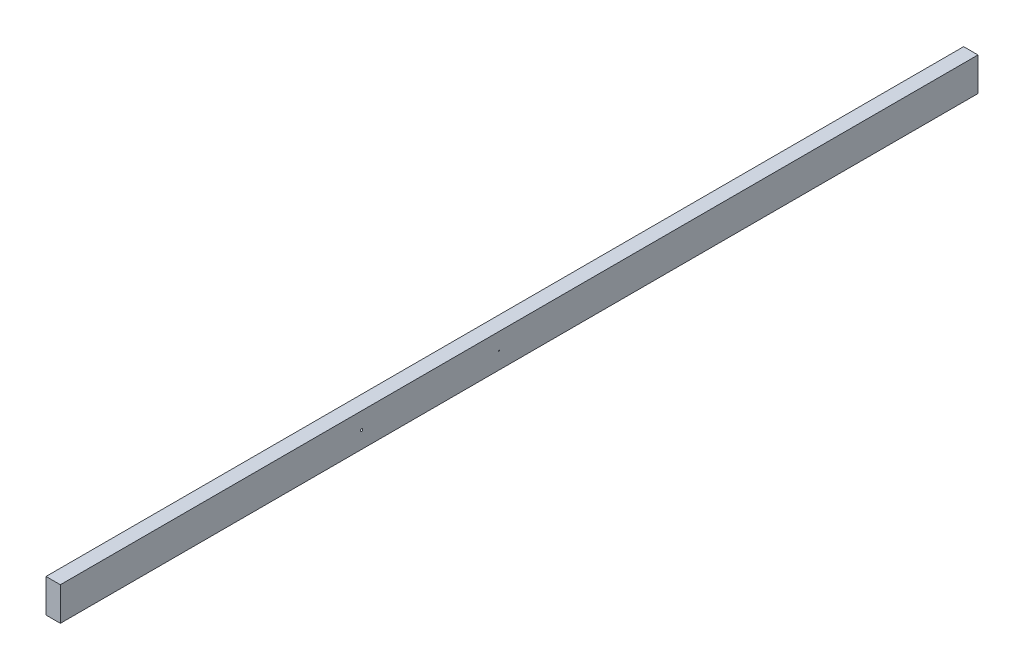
ISO-10303-21;
HEADER;
FILE_DESCRIPTION(('STEP AP214'),'2;1');
FILE_NAME('part.step','',(''),(''),'','','');
FILE_SCHEMA(('AUTOMOTIVE_DESIGN { 1 0 10303 214 1 1 1 1 }'));
ENDSEC;
DATA;
#1=APPLICATION_CONTEXT('core data for automotive mechanical design processes');
#2=APPLICATION_PROTOCOL_DEFINITION('international standard','automotive_design',2000,#1);
#3=PRODUCT_CONTEXT('',#1,'mechanical');
#4=PRODUCT('Part','Part','',(#3));
#5=PRODUCT_RELATED_PRODUCT_CATEGORY('part','',(#4));
#6=PRODUCT_DEFINITION_FORMATION('','',#4);
#7=PRODUCT_DEFINITION_CONTEXT('part definition',#1,'design');
#8=PRODUCT_DEFINITION('design','',#6,#7);
#9=PRODUCT_DEFINITION_SHAPE('','',#8);
#10=(LENGTH_UNIT() NAMED_UNIT(*) SI_UNIT(.MILLI.,.METRE.));
#11=(NAMED_UNIT(*) PLANE_ANGLE_UNIT() SI_UNIT($,.RADIAN.));
#12=(NAMED_UNIT(*) SI_UNIT($,.STERADIAN.) SOLID_ANGLE_UNIT());
#13=UNCERTAINTY_MEASURE_WITH_UNIT(LENGTH_MEASURE(1.E-05),#10,'distance_accuracy_value','');
#14=(GEOMETRIC_REPRESENTATION_CONTEXT(3) GLOBAL_UNCERTAINTY_ASSIGNED_CONTEXT((#13)) GLOBAL_UNIT_ASSIGNED_CONTEXT((#10,
#11,#12)) REPRESENTATION_CONTEXT('',''));
#15=CARTESIAN_POINT('',(0.,0.,0.));
#16=DIRECTION('',(0.,0.,1.));
#17=DIRECTION('',(1.,0.,0.));
#18=AXIS2_PLACEMENT_3D('',#15,#16,#17);
#19=CARTESIAN_POINT('',(19.05,-44.45,-2438.4));
#20=DIRECTION('',(1.,0.,0.));
#21=DIRECTION('',(0.,0.,-1.));
#22=AXIS2_PLACEMENT_3D('',#19,#20,#21);
#23=PLANE('',#22);
#24=CARTESIAN_POINT('',(19.05,0.,-800.1));
#25=DIRECTION('',(-1.,0.,0.));
#26=DIRECTION('',(0.,0.,1.));
#27=AXIS2_PLACEMENT_3D('',#24,#25,#26);
#28=CIRCLE('',#27,3.17500000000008);
#29=CARTESIAN_POINT('',(19.05,0.,-796.925));
#30=VERTEX_POINT('',#29);
#31=EDGE_CURVE('E150',#30,#30,#28,.T.);
#32=ORIENTED_EDGE('',*,*,#31,.T.);
#33=EDGE_LOOP('',(#32));
#34=FACE_BOUND('',#33,.T.);
#35=CARTESIAN_POINT('',(19.05,-1.0662952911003E-13,-1165.8854));
#36=DIRECTION('',(1.,0.,0.));
#37=DIRECTION('',(0.,0.,1.));
#38=AXIS2_PLACEMENT_3D('',#35,#36,#37);
#39=ELLIPSE('',#38,1.68379802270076,1.1906250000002);
#40=CARTESIAN_POINT('',(19.05,-1.10835133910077E-13,-1164.2016019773));
#41=VERTEX_POINT('',#40);
#42=EDGE_CURVE('E160',#41,#41,#39,.T.);
#43=ORIENTED_EDGE('',*,*,#42,.F.);
#44=EDGE_LOOP('',(#43));
#45=FACE_BOUND('',#44,.T.);
#46=DIRECTION('',(0.,1.,0.));
#47=VECTOR('',#46,1.);
#48=CARTESIAN_POINT('',(19.05,-44.45,0.));
#49=LINE('',#48,#47);
#50=CARTESIAN_POINT('',(19.05,-44.45,0.));
#51=VERTEX_POINT('',#50);
#52=CARTESIAN_POINT('',(19.05,44.45,0.));
#53=VERTEX_POINT('',#52);
#54=EDGE_CURVE('E100',#51,#53,#49,.T.);
#55=ORIENTED_EDGE('',*,*,#54,.F.);
#56=DIRECTION('',(0.,0.,1.));
#57=VECTOR('',#56,1.);
#58=CARTESIAN_POINT('',(19.05,-44.45,-2438.4));
#59=LINE('',#58,#57);
#60=CARTESIAN_POINT('',(19.05,-44.45,-2438.4));
#61=VERTEX_POINT('',#60);
#62=EDGE_CURVE('E11',#61,#51,#59,.T.);
#63=ORIENTED_EDGE('',*,*,#62,.F.);
#64=DIRECTION('',(0.,1.,0.));
#65=VECTOR('',#64,1.);
#66=CARTESIAN_POINT('',(19.05,-44.45,-2438.4));
#67=LINE('',#66,#65);
#68=CARTESIAN_POINT('',(19.05,44.45,-2438.4));
#69=VERTEX_POINT('',#68);
#70=EDGE_CURVE('E93',#61,#69,#67,.T.);
#71=ORIENTED_EDGE('',*,*,#70,.T.);
#72=DIRECTION('',(0.,0.,1.));
#73=VECTOR('',#72,1.);
#74=CARTESIAN_POINT('',(19.05,44.45,-2438.4));
#75=LINE('',#74,#73);
#76=EDGE_CURVE('E76',#69,#53,#75,.T.);
#77=ORIENTED_EDGE('',*,*,#76,.T.);
#78=EDGE_LOOP('',(#55,#63,#71,#77));
#79=FACE_BOUND('',#78,.T.);
#80=ADVANCED_FACE('F33',(#34,#45,#79),#23,.T.);
#81=CARTESIAN_POINT('',(-19.05,-44.45,-2438.4));
#82=DIRECTION('',(0.,-1.,0.));
#83=DIRECTION('',(0.,0.,-1.));
#84=AXIS2_PLACEMENT_3D('',#81,#82,#83);
#85=PLANE('',#84);
#86=DIRECTION('',(1.,0.,0.));
#87=VECTOR('',#86,1.);
#88=CARTESIAN_POINT('',(-19.05,-44.45,0.));
#89=LINE('',#88,#87);
#90=CARTESIAN_POINT('',(-19.05,-44.45,0.));
#91=VERTEX_POINT('',#90);
#92=EDGE_CURVE('E95',#91,#51,#89,.T.);
#93=ORIENTED_EDGE('',*,*,#92,.F.);
#94=DIRECTION('',(0.,0.,1.));
#95=VECTOR('',#94,1.);
#96=CARTESIAN_POINT('',(-19.05,-44.45,-2438.4));
#97=LINE('',#96,#95);
#98=CARTESIAN_POINT('',(-19.05,-44.45,-2438.4));
#99=VERTEX_POINT('',#98);
#100=EDGE_CURVE('E42',#99,#91,#97,.T.);
#101=ORIENTED_EDGE('',*,*,#100,.F.);
#102=DIRECTION('',(1.,0.,0.));
#103=VECTOR('',#102,1.);
#104=CARTESIAN_POINT('',(-19.05,-44.45,-2438.4));
#105=LINE('',#104,#103);
#106=EDGE_CURVE('E90',#99,#61,#105,.T.);
#107=ORIENTED_EDGE('',*,*,#106,.T.);
#108=ORIENTED_EDGE('',*,*,#62,.T.);
#109=EDGE_LOOP('',(#93,#101,#107,#108));
#110=FACE_BOUND('',#109,.T.);
#111=ADVANCED_FACE('F110',(#110),#85,.T.);
#112=CARTESIAN_POINT('',(-19.05,-44.45,-2438.4));
#113=DIRECTION('',(-1.,0.,0.));
#114=DIRECTION('',(0.,0.,1.));
#115=AXIS2_PLACEMENT_3D('',#112,#113,#114);
#116=PLANE('',#115);
#117=CARTESIAN_POINT('',(-19.05,0.,-800.1));
#118=DIRECTION('',(-1.,0.,0.));
#119=DIRECTION('',(0.,0.,1.));
#120=AXIS2_PLACEMENT_3D('',#117,#118,#119);
#121=CIRCLE('',#120,3.17500000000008);
#122=CARTESIAN_POINT('',(-19.05,0.,-796.925));
#123=VERTEX_POINT('',#122);
#124=EDGE_CURVE('E153',#123,#123,#121,.T.);
#125=ORIENTED_EDGE('',*,*,#124,.F.);
#126=EDGE_LOOP('',(#125));
#127=FACE_BOUND('',#126,.T.);
#128=CARTESIAN_POINT('',(-19.05,-1.45716771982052E-13,-1127.7854));
#129=DIRECTION('',(-1.,0.,0.));
#130=DIRECTION('',(0.,0.,-1.));
#131=AXIS2_PLACEMENT_3D('',#128,#129,#130);
#132=ELLIPSE('',#131,4.49012806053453,3.17499999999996);
#133=CARTESIAN_POINT('',(-19.05,-1.45716771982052E-13,-1132.27552806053));
#134=VERTEX_POINT('',#133);
#135=EDGE_CURVE('E36',#134,#134,#132,.F.);
#136=ORIENTED_EDGE('',*,*,#135,.T.);
#137=EDGE_LOOP('',(#136));
#138=FACE_BOUND('',#137,.T.);
#139=DIRECTION('',(0.,-1.,0.));
#140=VECTOR('',#139,1.);
#141=CARTESIAN_POINT('',(-19.05,-44.45,0.));
#142=LINE('',#141,#140);
#143=CARTESIAN_POINT('',(-19.05,44.45,0.));
#144=VERTEX_POINT('',#143);
#145=EDGE_CURVE('E84',#144,#91,#142,.T.);
#146=ORIENTED_EDGE('',*,*,#145,.F.);
#147=DIRECTION('',(0.,0.,1.));
#148=VECTOR('',#147,1.);
#149=CARTESIAN_POINT('',(-19.05,44.45,-2438.4));
#150=LINE('',#149,#148);
#151=CARTESIAN_POINT('',(-19.05,44.45,-2438.4));
#152=VERTEX_POINT('',#151);
#153=EDGE_CURVE('E79',#152,#144,#150,.T.);
#154=ORIENTED_EDGE('',*,*,#153,.F.);
#155=DIRECTION('',(0.,-1.,0.));
#156=VECTOR('',#155,1.);
#157=CARTESIAN_POINT('',(-19.05,-44.45,-2438.4));
#158=LINE('',#157,#156);
#159=EDGE_CURVE('E82',#152,#99,#158,.T.);
#160=ORIENTED_EDGE('',*,*,#159,.T.);
#161=ORIENTED_EDGE('',*,*,#100,.T.);
#162=EDGE_LOOP('',(#146,#154,#160,#161));
#163=FACE_BOUND('',#162,.T.);
#164=ADVANCED_FACE('F81',(#127,#138,#163),#116,.T.);
#165=CARTESIAN_POINT('',(-19.05,44.45,-2438.4));
#166=DIRECTION('',(0.,1.,0.));
#167=DIRECTION('',(0.,0.,1.));
#168=AXIS2_PLACEMENT_3D('',#165,#166,#167);
#169=PLANE('',#168);
#170=DIRECTION('',(-1.,0.,0.));
#171=VECTOR('',#170,1.);
#172=CARTESIAN_POINT('',(-19.05,44.45,0.));
#173=LINE('',#172,#171);
#174=EDGE_CURVE('E103',#53,#144,#173,.T.);
#175=ORIENTED_EDGE('',*,*,#174,.F.);
#176=ORIENTED_EDGE('',*,*,#76,.F.);
#177=DIRECTION('',(-1.,0.,0.));
#178=VECTOR('',#177,1.);
#179=CARTESIAN_POINT('',(-19.05,44.45,-2438.4));
#180=LINE('',#179,#178);
#181=EDGE_CURVE('E89',#69,#152,#180,.T.);
#182=ORIENTED_EDGE('',*,*,#181,.T.);
#183=ORIENTED_EDGE('',*,*,#153,.T.);
#184=EDGE_LOOP('',(#175,#176,#182,#183));
#185=FACE_BOUND('',#184,.T.);
#186=ADVANCED_FACE('F92',(#185),#169,.T.);
#187=CARTESIAN_POINT('',(0.,0.,-2438.4));
#188=DIRECTION('',(0.,0.,-1.));
#189=DIRECTION('',(-1.,0.,0.));
#190=AXIS2_PLACEMENT_3D('',#187,#188,#189);
#191=PLANE('',#190);
#192=ORIENTED_EDGE('',*,*,#70,.F.);
#193=ORIENTED_EDGE('',*,*,#106,.F.);
#194=ORIENTED_EDGE('',*,*,#159,.F.);
#195=ORIENTED_EDGE('',*,*,#181,.F.);
#196=EDGE_LOOP('',(#192,#193,#194,#195));
#197=FACE_BOUND('',#196,.T.);
#198=ADVANCED_FACE('F88',(#197),#191,.T.);
#199=CARTESIAN_POINT('',(0.,0.,0.));
#200=DIRECTION('',(0.,0.,-1.));
#201=DIRECTION('',(-1.,0.,0.));
#202=AXIS2_PLACEMENT_3D('',#199,#200,#201);
#203=PLANE('',#202);
#204=ORIENTED_EDGE('',*,*,#54,.T.);
#205=ORIENTED_EDGE('',*,*,#174,.T.);
#206=ORIENTED_EDGE('',*,*,#145,.T.);
#207=ORIENTED_EDGE('',*,*,#92,.T.);
#208=EDGE_LOOP('',(#204,#205,#206,#207));
#209=FACE_BOUND('',#208,.T.);
#210=ADVANCED_FACE('F109',(#209),#203,.F.);
#211=CARTESIAN_POINT('',(-54.9710244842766,-1.45716771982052E-13,-1091.86437551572));
#212=DIRECTION('',(0.707106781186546,0.,-0.707106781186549));
#213=DIRECTION('',(-0.707106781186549,0.,-0.707106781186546));
#214=AXIS2_PLACEMENT_3D('',#211,#212,#213);
#215=CYLINDRICAL_SURFACE('',#214,3.17499999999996);
#216=ORIENTED_EDGE('',*,*,#135,.F.);
#217=EDGE_LOOP('',(#216));
#218=FACE_BOUND('',#217,.T.);
#219=CARTESIAN_POINT('',(3.40064030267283,-1.45716771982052E-13,-1150.23604030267));
#220=DIRECTION('',(-0.707106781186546,0.,0.707106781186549));
#221=DIRECTION('',(0.707106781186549,0.,0.707106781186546));
#222=AXIS2_PLACEMENT_3D('',#219,#220,#221);
#223=CIRCLE('',#222,3.17499999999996);
#224=CARTESIAN_POINT('',(5.6457043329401,-1.45716771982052E-13,-1147.99097627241));
#225=VERTEX_POINT('',#224);
#226=EDGE_CURVE('E162',#225,#225,#223,.T.);
#227=ORIENTED_EDGE('',*,*,#226,.F.);
#228=EDGE_LOOP('',(#227));
#229=FACE_BOUND('',#228,.T.);
#230=ADVANCED_FACE('F129',(#218,#229),#215,.F.);
#231=CARTESIAN_POINT('',(3.40064030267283,-1.45716771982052E-13,-1150.23604030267));
#232=DIRECTION('',(-0.707106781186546,0.,0.707106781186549));
#233=DIRECTION('',(0.707106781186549,0.,0.707106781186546));
#234=AXIS2_PLACEMENT_3D('',#231,#232,#233);
#235=PLANE('',#234);
#236=CARTESIAN_POINT('',(3.40064030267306,-1.45716771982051E-13,-1150.23604030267));
#237=DIRECTION('',(-0.707106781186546,0.,0.707106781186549));
#238=DIRECTION('',(0.707106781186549,0.,0.707106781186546));
#239=AXIS2_PLACEMENT_3D('',#236,#237,#238);
#240=CIRCLE('',#239,1.1906250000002);
#241=CARTESIAN_POINT('',(4.24253931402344,-1.45716771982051E-13,-1149.39414129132));
#242=VERTEX_POINT('',#241);
#243=EDGE_CURVE('E155',#242,#242,#240,.T.);
#244=ORIENTED_EDGE('',*,*,#243,.F.);
#245=EDGE_LOOP('',(#244));
#246=FACE_BOUND('',#245,.T.);
#247=ORIENTED_EDGE('',*,*,#226,.T.);
#248=EDGE_LOOP('',(#247));
#249=FACE_BOUND('',#248,.T.);
#250=ADVANCED_FACE('F133',(#246,#249),#235,.T.);
#251=CARTESIAN_POINT('',(93.2032015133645,0.,-1240.03860151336));
#252=DIRECTION('',(-0.707106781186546,0.,0.707106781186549));
#253=DIRECTION('',(0.707106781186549,0.,0.707106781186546));
#254=AXIS2_PLACEMENT_3D('',#251,#252,#253);
#255=CYLINDRICAL_SURFACE('',#254,1.1906250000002);
#256=ORIENTED_EDGE('',*,*,#42,.T.);
#257=EDGE_LOOP('',(#256));
#258=FACE_BOUND('',#257,.T.);
#259=ORIENTED_EDGE('',*,*,#243,.T.);
#260=EDGE_LOOP('',(#259));
#261=FACE_BOUND('',#260,.T.);
#262=ADVANCED_FACE('F137',(#258,#261),#255,.F.);
#263=CARTESIAN_POINT('',(19.05,0.,-800.1));
#264=DIRECTION('',(-1.,0.,0.));
#265=DIRECTION('',(0.,0.,1.));
#266=AXIS2_PLACEMENT_3D('',#263,#264,#265);
#267=CYLINDRICAL_SURFACE('',#266,3.17500000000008);
#268=CARTESIAN_POINT('',(19.05,0.,-796.925));
#269=CARTESIAN_POINT('',(18.653125,0.,-796.925));
#270=CARTESIAN_POINT('',(18.25625,0.,-796.925));
#271=CARTESIAN_POINT('',(17.4625,0.,-796.925));
#272=CARTESIAN_POINT('',(17.065625,0.,-796.925));
#273=CARTESIAN_POINT('',(16.271875,0.,-796.925));
#274=CARTESIAN_POINT('',(15.875,0.,-796.925));
#275=CARTESIAN_POINT('',(15.08125,0.,-796.925));
#276=CARTESIAN_POINT('',(14.684375,0.,-796.925));
#277=CARTESIAN_POINT('',(13.890625,0.,-796.925));
#278=CARTESIAN_POINT('',(13.49375,0.,-796.925));
#279=CARTESIAN_POINT('',(12.7,0.,-796.925));
#280=CARTESIAN_POINT('',(12.303125,0.,-796.925));
#281=CARTESIAN_POINT('',(11.509375,0.,-796.925));
#282=CARTESIAN_POINT('',(11.1125,0.,-796.925));
#283=CARTESIAN_POINT('',(10.31875,0.,-796.925));
#284=CARTESIAN_POINT('',(9.921875,0.,-796.925));
#285=CARTESIAN_POINT('',(9.128125,0.,-796.925));
#286=CARTESIAN_POINT('',(8.73125,0.,-796.925));
#287=CARTESIAN_POINT('',(7.9375,0.,-796.925));
#288=CARTESIAN_POINT('',(7.540625,0.,-796.925));
#289=CARTESIAN_POINT('',(6.746875,0.,-796.925));
#290=CARTESIAN_POINT('',(6.35,0.,-796.925));
#291=CARTESIAN_POINT('',(5.55625,0.,-796.925));
#292=CARTESIAN_POINT('',(5.159375,0.,-796.925));
#293=CARTESIAN_POINT('',(4.365625,0.,-796.925));
#294=CARTESIAN_POINT('',(3.96875,0.,-796.925));
#295=CARTESIAN_POINT('',(3.175,0.,-796.925));
#296=CARTESIAN_POINT('',(2.778125,0.,-796.925));
#297=CARTESIAN_POINT('',(1.984375,0.,-796.925));
#298=CARTESIAN_POINT('',(1.5875,0.,-796.925));
#299=CARTESIAN_POINT('',(0.793750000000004,0.,-796.925));
#300=CARTESIAN_POINT('',(0.396875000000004,0.,-796.925));
#301=CARTESIAN_POINT('',(-0.396874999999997,0.,-796.925));
#302=CARTESIAN_POINT('',(-0.793749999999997,0.,-796.925));
#303=CARTESIAN_POINT('',(-1.5875,0.,-796.925));
#304=CARTESIAN_POINT('',(-1.984375,0.,-796.925));
#305=CARTESIAN_POINT('',(-2.778125,0.,-796.925));
#306=CARTESIAN_POINT('',(-3.175,0.,-796.925));
#307=CARTESIAN_POINT('',(-3.96875,0.,-796.925));
#308=CARTESIAN_POINT('',(-4.365625,0.,-796.925));
#309=CARTESIAN_POINT('',(-5.159375,0.,-796.925));
#310=CARTESIAN_POINT('',(-5.55625,0.,-796.925));
#311=CARTESIAN_POINT('',(-6.35,0.,-796.925));
#312=CARTESIAN_POINT('',(-6.746875,0.,-796.925));
#313=CARTESIAN_POINT('',(-7.540625,0.,-796.925));
#314=CARTESIAN_POINT('',(-7.9375,0.,-796.925));
#315=CARTESIAN_POINT('',(-8.73125,0.,-796.925));
#316=CARTESIAN_POINT('',(-9.128125,0.,-796.925));
#317=CARTESIAN_POINT('',(-9.921875,0.,-796.925));
#318=CARTESIAN_POINT('',(-10.31875,0.,-796.925));
#319=CARTESIAN_POINT('',(-11.1125,0.,-796.925));
#320=CARTESIAN_POINT('',(-11.509375,0.,-796.925));
#321=CARTESIAN_POINT('',(-12.303125,0.,-796.925));
#322=CARTESIAN_POINT('',(-12.7,0.,-796.925));
#323=CARTESIAN_POINT('',(-13.49375,0.,-796.925));
#324=CARTESIAN_POINT('',(-13.890625,0.,-796.925));
#325=CARTESIAN_POINT('',(-14.684375,0.,-796.925));
#326=CARTESIAN_POINT('',(-15.08125,0.,-796.925));
#327=CARTESIAN_POINT('',(-15.875,0.,-796.925));
#328=CARTESIAN_POINT('',(-16.271875,0.,-796.925));
#329=CARTESIAN_POINT('',(-17.065625,0.,-796.925));
#330=CARTESIAN_POINT('',(-17.4625,0.,-796.925));
#331=CARTESIAN_POINT('',(-18.25625,0.,-796.925));
#332=CARTESIAN_POINT('',(-18.653125,0.,-796.925));
#333=CARTESIAN_POINT('',(-19.05,0.,-796.925));
#334=B_SPLINE_CURVE_WITH_KNOTS('',3,(#268,#269,#270,#271,#272,#273,#274,#275,#276,#277,#278,
#279,#280,#281,#282,#283,#284,#285,#286,#287,#288,#289,#290,#291,#292,#293,#294,#295,#296,#297,
#298,#299,#300,#301,#302,#303,#304,#305,#306,#307,#308,#309,#310,#311,#312,#313,#314,#315,#316,
#317,#318,#319,#320,#321,#322,#323,#324,#325,#326,#327,#328,#329,#330,#331,#332,#333),
.UNSPECIFIED.,.F.,.F.,(4,2,2,2,2,2,2,2,2,2,2,2,2,2,2,2,2,2,2,2,2,2,2,2,2,2,2,2,2,2,2,2,4),(0.,
1.190625,2.38125,3.571875,4.7625,5.953125,7.14375,8.334375,9.525,10.715625,11.90625,13.096875,
14.2875,15.478125,16.66875,17.859375,19.05,20.240625,21.43125,22.621875,23.8125,25.003125,
26.19375,27.384375,28.575,29.765625,30.95625,32.146875,33.3375,34.528125,35.71875,36.909375,
38.1),.UNSPECIFIED.);
#335=EDGE_CURVE('BSEAM141',#30,#123,#334,.T.);
#336=ORIENTED_EDGE('',*,*,#31,.F.);
#337=ORIENTED_EDGE('',*,*,#124,.T.);
#338=ORIENTED_EDGE('',*,*,#335,.T.);
#339=ORIENTED_EDGE('',*,*,#335,.F.);
#340=EDGE_LOOP('',(#336,#338,#337,#339));
#341=FACE_BOUND('',#340,.T.);
#342=ADVANCED_FACE('F141',(#341),#267,.F.);
#343=CLOSED_SHELL('',(#80,#111,#164,#186,#198,#210,#230,#250,#262,#342));
#344=MANIFOLD_SOLID_BREP('B2',#343);
#345=ADVANCED_BREP_SHAPE_REPRESENTATION('',(#18,#344),#14);
#346=SHAPE_DEFINITION_REPRESENTATION(#9,#345);
ENDSEC;
END-ISO-10303-21;
